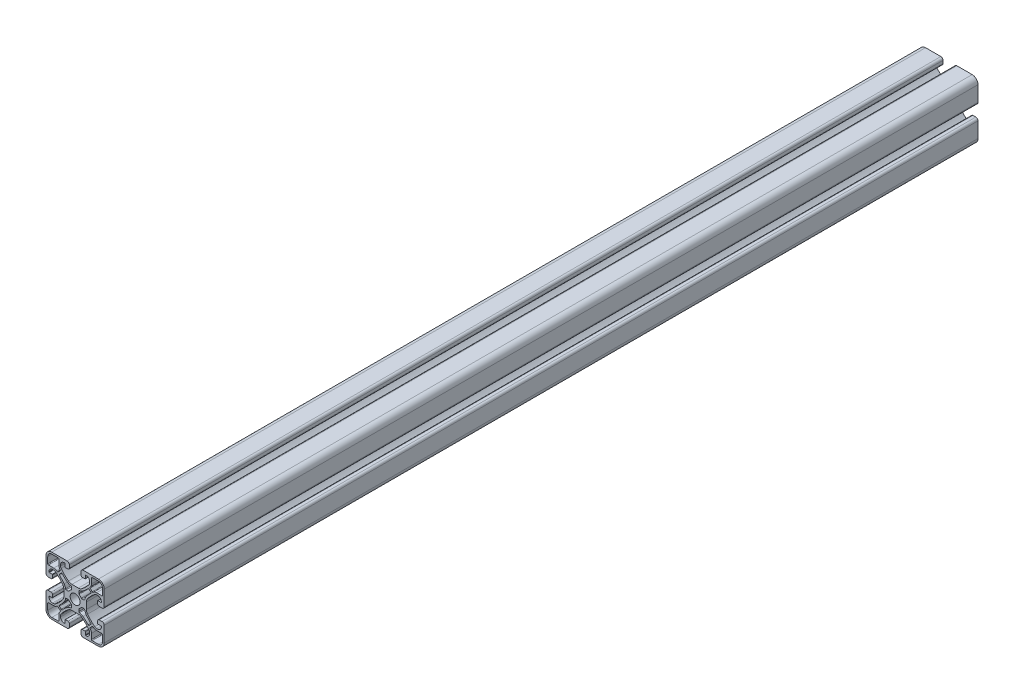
from build123d import *

# Parameters (mm, degrees)
ESQUISSE_PROFIL_R = 3.400000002
EXTRUSION1_DEPTH  = 600


with BuildPart() as part:
    # Esquisse profil → Extrusion1 (new body)
    with BuildSketch(Plane.XY):
        with BuildLine():
            Line((5.500000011, -20), (15.999999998, -20))
            ThreePointArc((15.999999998, -20), (18.82842711, -18.82842713), (20, -16.000000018))
            Line((20, -16.000000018), (20, -5.500000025))
            ThreePointArc((20, -5.500000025), (19.560660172, -4.439339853), (18.5, -4.000000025))
            Line((18.5, -4.000000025), (16.5, -4.000000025))
            ThreePointArc((16.5, -4.000000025), (15.792893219, -4.292893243), (15.5, -5.000000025))
            Line((15.5, -5.000000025), (15.5, -6.750000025))
            ThreePointArc((15.5, -6.750000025), (15.573223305, -6.92677672), (15.75, -7.000000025))
            Line((15.75, -7.000000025), (17.75, -7.000000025))
            ThreePointArc((17.75, -7.000000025), (17.926776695, -7.073223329), (18, -7.250000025))
            Line((18, -7.250000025), (18, -7.500000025))
            ThreePointArc((18, -7.500000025), (17.267766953, -9.267766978), (15.5, -10.000000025))
            Line((15.5, -10.000000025), (14.72036024, -10.000000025))
            ThreePointArc((14.72036024, -10.000000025), (14.083793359, -9.895991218), (13.51343504, -9.594782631))
            ThreePointArc((13.51343504, -9.594782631), (10.848996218, -7.2640298), (8.540476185, -4.580305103))
            ThreePointArc((8.540476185, -4.580305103), (7.952757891, -3.450415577), (7.75, -2.193056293))
            Line((7.75, -2.193056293), (7.75, 2.193056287))
            ThreePointArc((7.75, 2.193056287), (7.952757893, 3.450415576), (8.54047619, 4.580305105))
            ThreePointArc((8.54047619, 4.580305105), (10.848996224, 7.264029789), (13.513435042, 9.594782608))
            ThreePointArc((13.513435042, 9.594782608), (14.083793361, 9.895991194), (14.72036024, 10))
            Line((14.72036024, 10), (15.5, 10))
            ThreePointArc((15.5, 10), (17.267766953, 9.267766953), (18, 7.5))
            Line((18, 7.5), (18, 7.25))
            ThreePointArc((18, 7.25), (17.926776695, 7.073223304), (17.75, 7))
            Line((17.75, 7), (15.75, 7))
            ThreePointArc((15.75, 7), (15.573223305, 6.926776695), (15.5, 6.75))
            Line((15.5, 6.75), (15.5, 5))
            ThreePointArc((15.5, 5), (15.792893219, 4.292893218), (16.5, 4))
            Line((16.5, 4), (18.5, 4))
            ThreePointArc((18.5, 4), (19.560660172, 4.439339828), (20, 5.5))
            Line((20, 5.5), (20, 16.000000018))
            ThreePointArc((20, 16.000000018), (18.828427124, 18.828427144), (15.999999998, 20))
            Line((15.999999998, 20), (5.500000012, 20))
            ThreePointArc((5.500000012, 20), (4.43933984, 19.560660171), (4.000000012, 18.5))
            Line((4.000000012, 18.5), (4.000000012, 16.5))
            ThreePointArc((4.000000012, 16.5), (4.292893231, 15.792893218), (5.000000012, 15.5))
            Line((5.000000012, 15.5), (6.750000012, 15.5))
            ThreePointArc((6.750000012, 15.5), (6.926776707, 15.573223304), (7.000000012, 15.75))
            Line((7.000000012, 15.75), (7.000000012, 17.75))
            ThreePointArc((7.000000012, 17.75), (7.073223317, 17.926776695), (7.250000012, 18))
            Line((7.250000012, 18), (7.500000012, 18))
            ThreePointArc((7.500000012, 18), (9.267766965, 17.267766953), (10.000000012, 15.5))
            Line((10.000000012, 15.5), (10.000000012, 14.72036024))
            ThreePointArc((10.000000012, 14.72036024), (9.895991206, 14.083793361), (9.594782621, 13.513435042))
            ThreePointArc((9.594782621, 13.513435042), (7.264029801, 10.848996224), (4.580305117, 8.540476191))
            ThreePointArc((4.580305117, 8.540476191), (3.450415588, 7.952757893), (2.193056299, 7.75))
            Line((2.193056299, 7.75), (-2.193056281, 7.75))
            ThreePointArc((-2.193056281, 7.75), (-3.45041557, 7.952757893), (-4.580305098, 8.54047619))
            ThreePointArc((-4.580305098, 8.54047619), (-7.264029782, 10.848996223), (-9.594782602, 13.513435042))
            ThreePointArc((-9.594782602, 13.513435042), (-9.895991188, 14.08379336), (-9.999999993, 14.72036024))
            Line((-9.999999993, 14.72036024), (-9.999999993, 15.5))
            ThreePointArc((-9.999999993, 15.5), (-9.267766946, 17.267766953), (-7.499999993, 18))
            Line((-7.499999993, 18), (-7.249999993, 18))
            ThreePointArc((-7.249999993, 18), (-7.073223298, 17.926776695), (-6.999999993, 17.75))
            Line((-6.999999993, 17.75), (-6.999999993, 15.75))
            ThreePointArc((-6.999999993, 15.75), (-6.926776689, 15.573223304), (-6.749999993, 15.5))
            Line((-6.749999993, 15.5), (-4.999999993, 15.5))
            ThreePointArc((-4.999999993, 15.5), (-4.292893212, 15.792893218), (-3.999999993, 16.5))
            Line((-3.999999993, 16.5), (-3.999999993, 18.5))
            ThreePointArc((-3.999999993, 18.5), (-4.439339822, 19.560660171), (-5.499999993, 20))
            Line((-5.499999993, 20), (-15.999999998, 20))
            ThreePointArc((-15.999999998, 20), (-18.82842711, 18.82842713), (-20, 16.000000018))
            Line((-20, 16.000000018), (-20, 5.499999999))
            ThreePointArc((-20, 5.499999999), (-19.560660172, 4.439339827), (-18.5, 3.999999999))
            Line((-18.5, 3.999999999), (-16.5, 3.999999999))
            ThreePointArc((-16.5, 3.999999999), (-15.792893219, 4.292893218), (-15.5, 4.999999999))
            Line((-15.5, 4.999999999), (-15.5, 6.749999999))
            ThreePointArc((-15.5, 6.749999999), (-15.573223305, 6.926776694), (-15.75, 6.999999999))
            Line((-15.75, 6.999999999), (-17.75, 6.999999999))
            ThreePointArc((-17.75, 6.999999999), (-17.926776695, 7.073223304), (-18, 7.249999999))
            Line((-18, 7.249999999), (-18, 7.499999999))
            ThreePointArc((-18, 7.499999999), (-17.267766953, 9.267766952), (-15.5, 9.999999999))
            Line((-15.5, 9.999999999), (-14.72036024, 9.999999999))
            ThreePointArc((-14.72036024, 9.999999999), (-14.083793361, 9.895991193), (-13.513435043, 9.594782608))
            ThreePointArc((-13.513435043, 9.594782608), (-10.848996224, 7.264029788), (-8.540476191, 4.580305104))
            ThreePointArc((-8.540476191, 4.580305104), (-7.952757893, 3.450415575), (-7.75, 2.193056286))
            Line((-7.75, 2.193056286), (-7.75, -2.193056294))
            ThreePointArc((-7.75, -2.193056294), (-7.952757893, -3.450415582), (-8.54047619, -4.580305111))
            ThreePointArc((-8.54047619, -4.580305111), (-10.848996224, -7.264029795), (-13.513435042, -9.594782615))
            ThreePointArc((-13.513435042, -9.594782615), (-14.083793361, -9.8959912), (-14.72036024, -10.000000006))
            Line((-14.72036024, -10.000000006), (-15.5, -10.000000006))
            ThreePointArc((-15.5, -10.000000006), (-17.267766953, -9.267766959), (-18, -7.500000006))
            Line((-18, -7.500000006), (-18, -7.250000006))
            ThreePointArc((-18, -7.250000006), (-17.926776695, -7.073223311), (-17.75, -7.000000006))
            Line((-17.75, -7.000000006), (-15.75, -7.000000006))
            ThreePointArc((-15.75, -7.000000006), (-15.573223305, -6.926776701), (-15.5, -6.750000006))
            Line((-15.5, -6.750000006), (-15.5, -5.000000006))
            ThreePointArc((-15.5, -5.000000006), (-15.792893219, -4.292893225), (-16.5, -4.000000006))
            Line((-16.5, -4.000000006), (-18.5, -4.000000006))
            ThreePointArc((-18.5, -4.000000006), (-19.560660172, -4.439339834), (-20, -5.500000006))
            Line((-20, -5.500000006), (-20, -15.999999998))
            ThreePointArc((-20, -15.999999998), (-18.828427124, -18.828427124), (-15.999999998, -20))
            Line((-15.999999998, -20), (-5.499999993, -20))
            ThreePointArc((-5.499999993, -20), (-4.439339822, -19.560660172), (-3.999999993, -18.5))
            Line((-3.999999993, -18.5), (-3.999999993, -16.5))
            ThreePointArc((-3.999999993, -16.5), (-4.292893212, -15.792893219), (-4.999999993, -15.5))
            Line((-4.999999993, -15.5), (-6.749999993, -15.5))
            ThreePointArc((-6.749999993, -15.5), (-6.926776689, -15.573223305), (-6.999999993, -15.75))
            Line((-6.999999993, -15.75), (-6.999999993, -17.75))
            ThreePointArc((-6.999999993, -17.75), (-7.073223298, -17.926776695), (-7.249999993, -18))
            Line((-7.249999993, -18), (-7.499999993, -18))
            ThreePointArc((-7.499999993, -18), (-9.267766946, -17.267766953), (-9.999999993, -15.5))
            Line((-9.999999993, -15.5), (-9.999999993, -14.72036024))
            ThreePointArc((-9.999999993, -14.72036024), (-9.895991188, -14.083793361), (-9.594782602, -13.513435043))
            ThreePointArc((-9.594782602, -13.513435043), (-7.264029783, -10.848996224), (-4.580305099, -8.540476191))
            ThreePointArc((-4.580305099, -8.540476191), (-3.45041557, -7.952757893), (-2.193056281, -7.75))
            Line((-2.193056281, -7.75), (2.193056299, -7.75))
            ThreePointArc((2.193056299, -7.75), (3.450415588, -7.952757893), (4.580305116, -8.54047619))
            ThreePointArc((4.580305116, -8.54047619), (7.264029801, -10.848996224), (9.59478262, -13.513435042))
            ThreePointArc((9.59478262, -13.513435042), (9.895991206, -14.083793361), (10.000000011, -14.72036024))
            Line((10.000000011, -14.72036024), (10.000000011, -15.5))
            ThreePointArc((10.000000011, -15.5), (9.267766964, -17.267766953), (7.500000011, -18))
            Line((7.500000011, -18), (7.250000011, -18))
            ThreePointArc((7.250000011, -18), (7.073223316, -17.926776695), (7.000000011, -17.75))
            Line((7.000000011, -17.75), (7.000000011, -15.75))
            ThreePointArc((7.000000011, -15.75), (6.926776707, -15.573223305), (6.750000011, -15.5))
            Line((6.750000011, -15.5), (5.000000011, -15.5))
            ThreePointArc((5.000000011, -15.5), (4.29289323, -15.792893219), (4.000000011, -16.5))
            Line((4.000000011, -16.5), (4.000000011, -18.5))
            ThreePointArc((4.000000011, -18.5), (4.43933984, -19.560660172), (5.500000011, -20))
        make_face()
        Circle(ESQUISSE_PROFIL_R, mode=Mode.SUBTRACT)
        with BuildLine():
            Line((11.699666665, 18.8), (15.999999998, 18.8))
            ThreePointArc((15.999999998, 18.8), (17.979898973, 17.979898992), (18.8, 16.000000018))
            Line((18.8, 16.000000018), (18.8, 11.699999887))
            ThreePointArc((18.8, 11.699999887), (18.653553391, 11.346446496), (18.3, 11.199999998))
            Line((18.3, 11.199999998), (14.670026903, 11.199999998))
            ThreePointArc((14.670026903, 11.199999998), (13.651519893, 11.033585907), (12.738946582, 10.551652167))
            Line((12.738946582, 10.551652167), (12.395722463, 10.287411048))
            ThreePointArc((12.395722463, 10.287411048), (12.057202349, 10.181979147), (11.733887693, 10.327510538))
            Line((11.733887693, 10.327510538), (10.327177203, 11.734221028))
            ThreePointArc((10.327177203, 11.734221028), (10.181645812, 12.057535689), (10.287077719, 12.396055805))
            Line((10.287077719, 12.396055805), (10.551318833, 12.739279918))
            ThreePointArc((10.551318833, 12.739279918), (11.033252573, 13.651853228), (11.199666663, 14.670360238))
            Line((11.199666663, 14.670360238), (11.199666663, 18.299999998))
            ThreePointArc((11.199666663, 18.299999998), (11.346113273, 18.65355339), (11.699666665, 18.8))
        make_face(mode=Mode.SUBTRACT)
        with BuildLine():
            Line((-11.199666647, 14.669919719), (-11.199666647, 18.299999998))
            ThreePointArc((-11.199666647, 18.299999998), (-11.346113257, 18.65355339), (-11.699666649, 18.8))
            Line((-11.699666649, 18.8), (-15.999999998, 18.8))
            ThreePointArc((-15.999999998, 18.8), (-17.979898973, 17.979898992), (-18.8, 16.000000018))
            Line((-18.8, 16.000000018), (-18.8, 11.699999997))
            ThreePointArc((-18.8, 11.699999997), (-18.653553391, 11.346446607), (-18.3, 11.199999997))
            Line((-18.3, 11.199999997), (-14.67036024, 11.199999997))
            ThreePointArc((-14.67036024, 11.199999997), (-13.65185323, 11.033585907), (-12.739279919, 10.551652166))
            Line((-12.739279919, 10.551652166), (-12.3960558, 10.287411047))
            ThreePointArc((-12.3960558, 10.287411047), (-12.057535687, 10.181979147), (-11.73422103, 10.327510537))
            Line((-11.73422103, 10.327510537), (-10.32751054, 11.734221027))
            ThreePointArc((-10.32751054, 11.734221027), (-10.181979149, 12.057535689), (-10.287411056, 12.396055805))
            Line((-10.287411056, 12.396055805), (-10.551651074, 12.739278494))
            ThreePointArc((-10.551651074, 12.739278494), (-11.033340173, 13.651673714), (-11.199666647, 14.669919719))
        make_face(mode=Mode.SUBTRACT)
        with BuildLine():
            Line((-2.500000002, 6.098239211), (-2.500000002, 4.609772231))
            ThreePointArc((-2.500000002, 4.609772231), (-2.560475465, 4.371406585), (-2.727272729, 4.19070203))
            ThreePointArc((-2.727272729, 4.19070203), (-3.535533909, 3.535533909), (-4.19070203, 2.727272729))
            ThreePointArc((-4.19070203, 2.727272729), (-4.371406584, 2.560475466), (-4.609772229, 2.500000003))
            Line((-4.609772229, 2.500000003), (-6.098239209, 2.500000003))
            ThreePointArc((-6.098239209, 2.500000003), (-6.428045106, 2.62419677), (-6.594007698, 2.935087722))
            ThreePointArc((-6.594007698, 2.935087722), (-6.934262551, 4.221803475), (-7.589999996, 5.380000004))
            ThreePointArc((-7.589999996, 5.380000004), (-9.089852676, 7.202595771), (-10.747651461, 8.882809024))
            ThreePointArc((-10.747651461, 8.882809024), (-10.907820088, 9.24007063), (-10.761465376, 9.603209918))
            Line((-10.761465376, 9.603209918), (-9.603209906, 10.761465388))
            ThreePointArc((-9.603209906, 10.761465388), (-9.240070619, 10.907820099), (-8.882809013, 10.747651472))
            ThreePointArc((-8.882809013, 10.747651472), (-7.202595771, 9.089852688), (-5.380000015, 7.590000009))
            ThreePointArc((-5.380000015, 7.590000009), (-4.221803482, 6.934262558), (-2.935087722, 6.594007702))
            ThreePointArc((-2.935087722, 6.594007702), (-2.624196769, 6.428045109), (-2.500000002, 6.098239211))
        make_face(mode=Mode.SUBTRACT)
        with BuildLine():
            Line((-10.761465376, -9.603209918), (-9.603209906, -10.761465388))
            ThreePointArc((-9.603209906, -10.761465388), (-9.240070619, -10.907820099), (-8.882809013, -10.747651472))
            ThreePointArc((-8.882809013, -10.747651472), (-7.202595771, -9.089852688), (-5.380000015, -7.590000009))
            ThreePointArc((-5.380000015, -7.590000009), (-4.221803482, -6.934262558), (-2.935087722, -6.594007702))
            ThreePointArc((-2.935087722, -6.594007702), (-2.624196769, -6.428045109), (-2.500000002, -6.098239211))
            Line((-2.500000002, -6.098239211), (-2.500000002, -4.609772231))
            ThreePointArc((-2.500000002, -4.609772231), (-2.560475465, -4.371406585), (-2.727272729, -4.19070203))
            ThreePointArc((-2.727272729, -4.19070203), (-3.535533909, -3.535533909), (-4.19070203, -2.727272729))
            ThreePointArc((-4.19070203, -2.727272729), (-4.371406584, -2.560475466), (-4.609772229, -2.500000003))
            Line((-4.609772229, -2.500000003), (-6.098239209, -2.500000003))
            ThreePointArc((-6.098239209, -2.500000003), (-6.428045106, -2.62419677), (-6.594007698, -2.935087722))
            ThreePointArc((-6.594007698, -2.935087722), (-6.934262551, -4.221803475), (-7.589999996, -5.380000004))
            ThreePointArc((-7.589999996, -5.380000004), (-9.089852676, -7.202595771), (-10.747651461, -8.882809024))
            ThreePointArc((-10.747651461, -8.882809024), (-10.907820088, -9.24007063), (-10.761465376, -9.603209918))
        make_face(mode=Mode.SUBTRACT)
        with BuildLine():
            Line((-11.699999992, -18.8), (-15.999999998, -18.8))
            ThreePointArc((-15.999999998, -18.8), (-17.979898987, -17.979898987), (-18.8, -15.999999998))
            Line((-18.8, -15.999999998), (-18.8, -11.700000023))
            ThreePointArc((-18.8, -11.700000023), (-18.653553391, -11.346446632), (-18.3, -11.200000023))
            Line((-18.3, -11.200000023), (-14.67036024, -11.200000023))
            ThreePointArc((-14.67036024, -11.200000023), (-13.65185323, -11.033585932), (-12.739279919, -10.551652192))
            Line((-12.739279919, -10.551652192), (-12.3960558, -10.287411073))
            ThreePointArc((-12.3960558, -10.287411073), (-12.057535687, -10.181979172), (-11.73422103, -10.327510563))
            Line((-11.73422103, -10.327510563), (-10.32751054, -11.734221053))
            ThreePointArc((-10.32751054, -11.734221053), (-10.181979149, -12.057535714), (-10.287411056, -12.39605583))
            Line((-10.287411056, -12.39605583), (-10.55165217, -12.739279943))
            ThreePointArc((-10.55165217, -12.739279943), (-11.033585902, -13.651853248), (-11.19999999, -14.670360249))
            Line((-11.19999999, -14.670360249), (-11.19999999, -18.299999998))
            ThreePointArc((-11.19999999, -18.299999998), (-11.3464466, -18.65355339), (-11.699999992, -18.8))
        make_face(mode=Mode.SUBTRACT)
        with BuildLine():
            Line((9.603209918, 10.761465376), (10.761465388, 9.603209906))
            ThreePointArc((10.761465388, 9.603209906), (10.907820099, 9.240070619), (10.747651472, 8.882809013))
            ThreePointArc((10.747651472, 8.882809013), (9.089852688, 7.202595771), (7.590000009, 5.380000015))
            ThreePointArc((7.590000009, 5.380000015), (6.934262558, 4.221803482), (6.594007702, 2.935087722))
            ThreePointArc((6.594007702, 2.935087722), (6.428045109, 2.624196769), (6.098239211, 2.500000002))
            Line((6.098239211, 2.500000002), (4.609772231, 2.500000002))
            ThreePointArc((4.609772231, 2.500000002), (4.371406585, 2.560475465), (4.19070203, 2.727272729))
            ThreePointArc((4.19070203, 2.727272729), (3.535533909, 3.535533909), (2.727272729, 4.19070203))
            ThreePointArc((2.727272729, 4.19070203), (2.560475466, 4.371406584), (2.500000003, 4.609772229))
            Line((2.500000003, 4.609772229), (2.500000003, 6.098239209))
            ThreePointArc((2.500000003, 6.098239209), (2.62419677, 6.428045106), (2.935087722, 6.594007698))
            ThreePointArc((2.935087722, 6.594007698), (4.221803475, 6.934262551), (5.380000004, 7.589999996))
            ThreePointArc((5.380000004, 7.589999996), (7.202595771, 9.089852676), (8.882809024, 10.747651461))
            ThreePointArc((8.882809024, 10.747651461), (9.24007063, 10.907820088), (9.603209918, 10.761465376))
        make_face(mode=Mode.SUBTRACT)
        with BuildLine():
            Line((2.500000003, -4.609772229), (2.500000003, -6.098239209))
            ThreePointArc((2.500000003, -6.098239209), (2.62419677, -6.428045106), (2.935087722, -6.594007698))
            ThreePointArc((2.935087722, -6.594007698), (4.221803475, -6.934262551), (5.380000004, -7.589999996))
            ThreePointArc((5.380000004, -7.589999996), (7.202595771, -9.089852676), (8.882809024, -10.747651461))
            ThreePointArc((8.882809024, -10.747651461), (9.24007063, -10.907820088), (9.603209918, -10.761465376))
            Line((9.603209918, -10.761465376), (10.761465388, -9.603209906))
            ThreePointArc((10.761465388, -9.603209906), (10.907820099, -9.240070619), (10.747651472, -8.882809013))
            ThreePointArc((10.747651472, -8.882809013), (9.089852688, -7.202595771), (7.590000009, -5.380000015))
            ThreePointArc((7.590000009, -5.380000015), (6.934262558, -4.221803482), (6.594007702, -2.935087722))
            ThreePointArc((6.594007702, -2.935087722), (6.428045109, -2.624196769), (6.098239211, -2.500000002))
            Line((6.098239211, -2.500000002), (4.609772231, -2.500000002))
            ThreePointArc((4.609772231, -2.500000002), (4.371406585, -2.560475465), (4.19070203, -2.727272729))
            ThreePointArc((4.19070203, -2.727272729), (3.535533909, -3.535533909), (2.727272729, -4.19070203))
            ThreePointArc((2.727272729, -4.19070203), (2.560475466, -4.371406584), (2.500000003, -4.609772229))
        make_face(mode=Mode.SUBTRACT)
        with BuildLine():
            Line((11.199666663, -14.670360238), (11.199666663, -18.299999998))
            ThreePointArc((11.199666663, -18.299999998), (11.346113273, -18.65355339), (11.699666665, -18.8))
            Line((11.699666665, -18.8), (15.999999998, -18.8))
            ThreePointArc((15.999999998, -18.8), (17.979898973, -17.979898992), (18.8, -16.000000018))
            Line((18.8, -16.000000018), (18.8, -11.699999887))
            ThreePointArc((18.8, -11.699999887), (18.653553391, -11.346446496), (18.3, -11.199999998))
            Line((18.3, -11.199999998), (14.670026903, -11.199999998))
            ThreePointArc((14.670026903, -11.199999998), (13.651519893, -11.033585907), (12.738946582, -10.551652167))
            Line((12.738946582, -10.551652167), (12.395722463, -10.287411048))
            ThreePointArc((12.395722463, -10.287411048), (12.057202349, -10.181979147), (11.733887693, -10.327510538))
            Line((11.733887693, -10.327510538), (10.327177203, -11.734221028))
            ThreePointArc((10.327177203, -11.734221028), (10.181645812, -12.057535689), (10.287077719, -12.396055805))
            Line((10.287077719, -12.396055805), (10.551318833, -12.739279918))
            ThreePointArc((10.551318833, -12.739279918), (11.033252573, -13.651853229), (11.199666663, -14.670360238))
        make_face(mode=Mode.SUBTRACT)
    extrude(amount=EXTRUSION1_DEPTH)


solid = part.part
